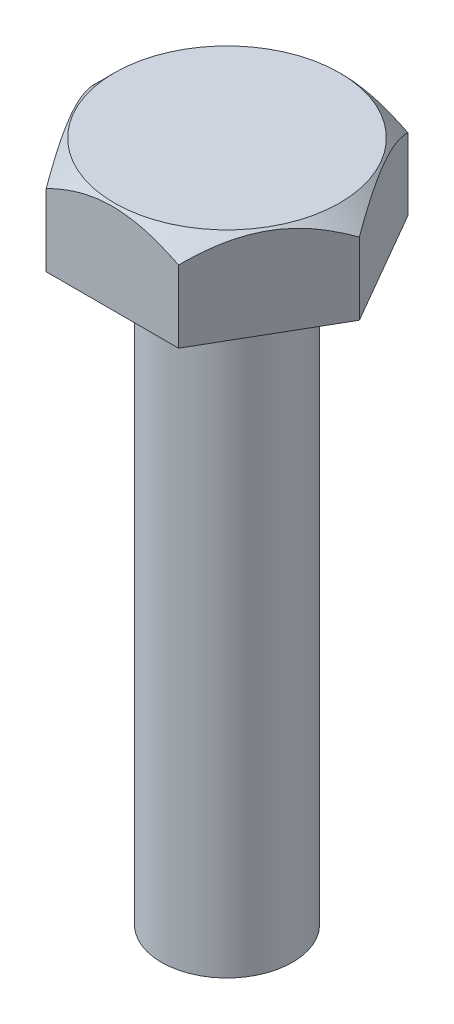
from build123d import *

# Parameters (mm, degrees)
SKIZZE2_R                       = 2
AUFSATZ_LINEAR_AUSTRAGEN1_DEPTH = 18
AUFSATZ_LINEAR_AUSTRAGEN2_DEPTH = 2.8


with BuildPart() as part:
    # Skizze2 → Aufsatz-Linear austragen1 (new body)
    with BuildSketch(Plane(origin=(0, 0, 0), x_dir=(1, 0, 0), z_dir=(0, 1, 0))):
        with Locations(Location((0, 0, 0), (0, 0, 270))):
            Circle(SKIZZE2_R)
    extrude(amount=AUFSATZ_LINEAR_AUSTRAGEN1_DEPTH)

    # Skizze3 → Aufsatz-Linear austragen2 (add)
    with BuildSketch(Plane(origin=(0, 18, 0), x_dir=(1, 0, 0), z_dir=(0, 1, 0))):
        Polygon((2.020725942, 3.5), (-2.020725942, 3.5), (-4.041451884, 0), (-2.020725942, -3.5), (2.020725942, -3.5), (4.041451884, 0), align=None)
    extrude(amount=AUFSATZ_LINEAR_AUSTRAGEN2_DEPTH)

    # Skizze4 → Schnitt-Rotation1 (revolve, cut)
    with BuildSketch(Plane.XY, mode=Mode.PRIVATE) as schnitt_rotation1_sk:
        Polygon((-4.041451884, 20.8), (-4.041451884, 20.2), (-3.441451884, 20.8), align=None)
    revolve(schnitt_rotation1_sk.sketch.rotate(Axis((0, 0, 0), (0, 1, 0)), 270), axis=Axis((0, 0, 0), (0, 1, 0)), mode=Mode.SUBTRACT)


solid = part.part
